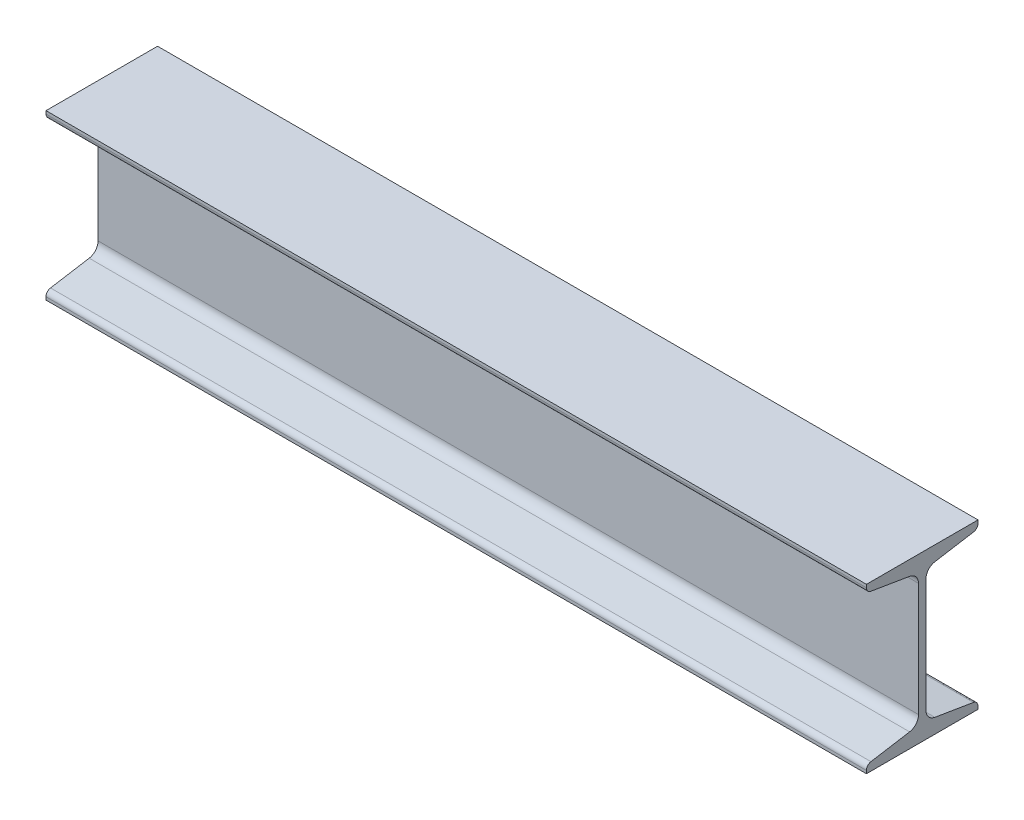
from build123d import *

# Parameters (mm, degrees)
BASE_DEPTH = 500
FILLET1_R  = 6.5
FILLET2_R  = 3.3


with BuildPart() as part:
    # Sketch1 → Base (new body)
    with BuildSketch(Plane(origin=(0, 0, 0), x_dir=(0, 0, -1), z_dir=(1, 0, 0))):
        Polygon((-34, 0), (34, 0), (34, 4.579166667), (2.25, 9.870833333), (2.25, 90.129166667), (34, 95.420833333), (34, 100), (-34, 100), (-34, 95.420833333), (-2.25, 90.129166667), (-2.25, 9.870833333), (-34, 4.579166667), align=None)
    extrude(amount=BASE_DEPTH)

    # Fillet1
    fillet1_edges = [part.edges().sort_by_distance(p)[0] for p in [
        (250, 9.870833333, 2.25),
        (250, 90.129166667, 2.25),
        (250, 90.129166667, -2.25),
        (250, 9.870833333, -2.25),
    ]]
    fillet(fillet1_edges, radius=FILLET1_R)

    # Fillet2
    fillet2_edges = [part.edges().sort_by_distance(p)[0] for p in [
        (250, 4.579166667, 34),
        (250, 95.420833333, 34),
        (250, 95.420833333, -34),
        (250, 4.579166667, -34),
    ]]
    fillet(fillet2_edges, radius=FILLET2_R)


solid = part.part
